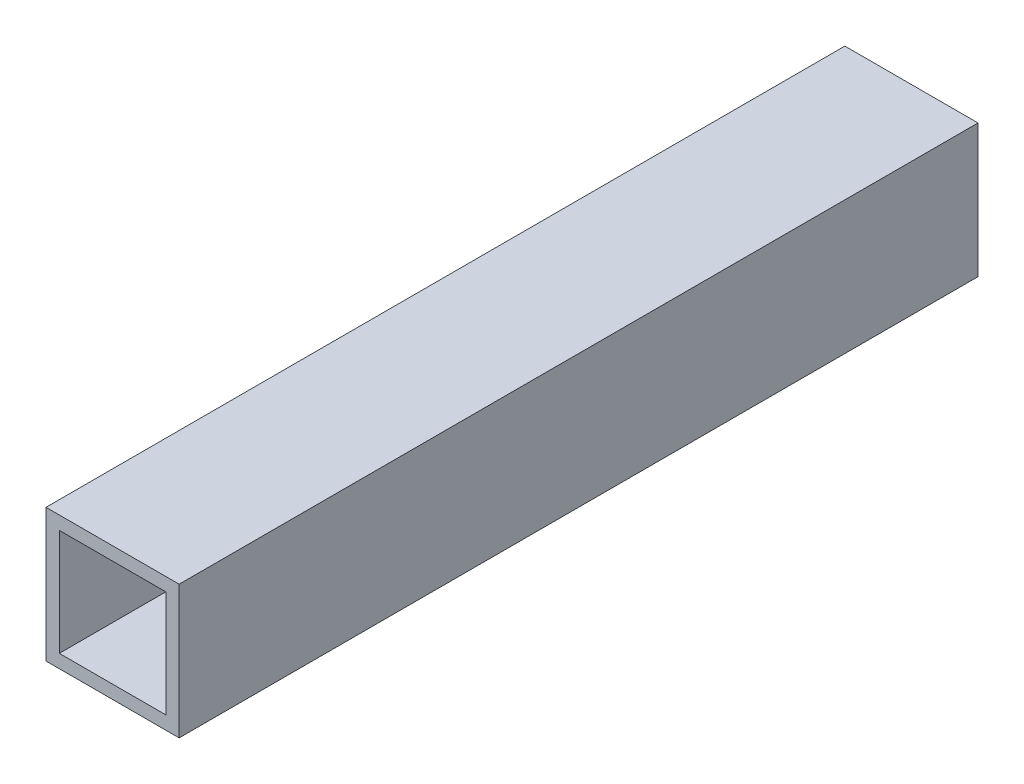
from build123d import *

# Parameters (mm, degrees)
ESQUISSE1_W        = 50
ESQUISSE1_H        = 50
ESQUISSE1_W_2      = 40
ESQUISSE1_H_2      = 40
BOSS_EXTRU_1_DEPTH = 300


with BuildPart() as part:
    # Esquisse1 → Boss.-Extru.1 (new body)
    with BuildSketch(Plane.XY):
        with Locations((-25, 25)):
            Rectangle(ESQUISSE1_W, ESQUISSE1_H)
        with Locations((-25, 25)):
            Rectangle(ESQUISSE1_W_2, ESQUISSE1_H_2, mode=Mode.SUBTRACT)
    extrude(amount=BOSS_EXTRU_1_DEPTH)


solid = part.part
